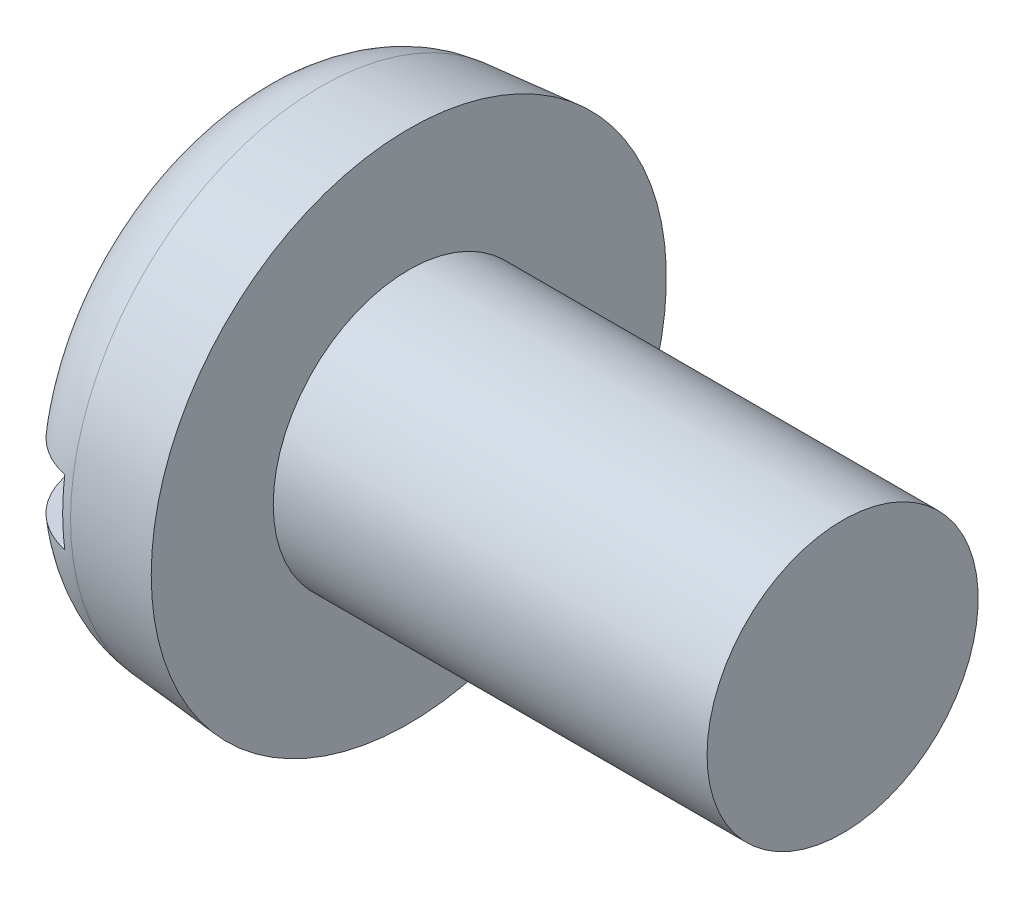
from build123d import *

# Parameters (mm, degrees)
FILLET2_R  = 1.5
SKETCH2_W  = 9.5
SKETCH2_H  = 1.2
SLOT_DEPTH = 1.2


with BuildPart() as part:
    # BodySke → Base-Revolve (revolve)
    with BuildSketch(Plane.XY, mode=Mode.PRIVATE) as base_revolve_sk:
        Polygon((3, 2.5), (3, 4.75), (0, 4.487534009), (0, 0), (11, 0), (11, 2.5), align=None)
    revolve(base_revolve_sk.sketch.rotate(Axis((-25.4, 0, 0), (1, 0, 0)), 90), axis=Axis((-25.4, 0, 0), (1, 0, 0)))

    # Fillet2
    fillet2_edges = [part.edges().sort_by_distance(p)[0] for p in [
        (0, 0, -4.487534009),
    ]]
    fillet(fillet2_edges, radius=FILLET2_R)

    # Sketch2 → Slot (cut)
    with BuildSketch(Plane(origin=(0, 0, 0), x_dir=(0, 0, -1), z_dir=(1, 0, 0))):
        Rectangle(SKETCH2_W, SKETCH2_H)
    extrude(amount=SLOT_DEPTH, mode=Mode.SUBTRACT)


solid = part.part
